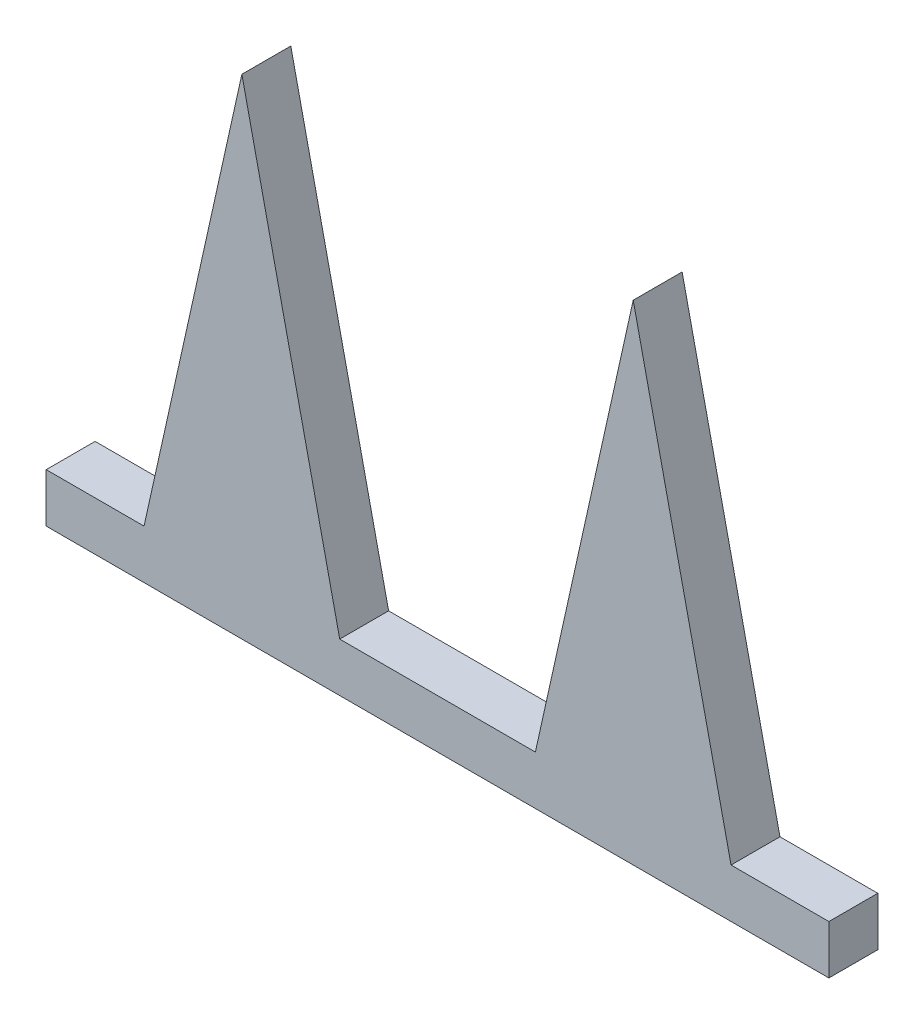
from build123d import *

# Parameters (mm, degrees)
EXTRUDE1_DEPTH = 10


with BuildPart() as part:
    # Sketch1 → Extrude1 (new body)
    with BuildSketch(Plane.XY):
        Polygon((20, 10), (40, 100), (60, 10), (100, 10), (120, 100), (140, 10), (160, 10), (160, 0), (0, 0), (0, 10), align=None)
    extrude(amount=EXTRUDE1_DEPTH)


solid = part.part
